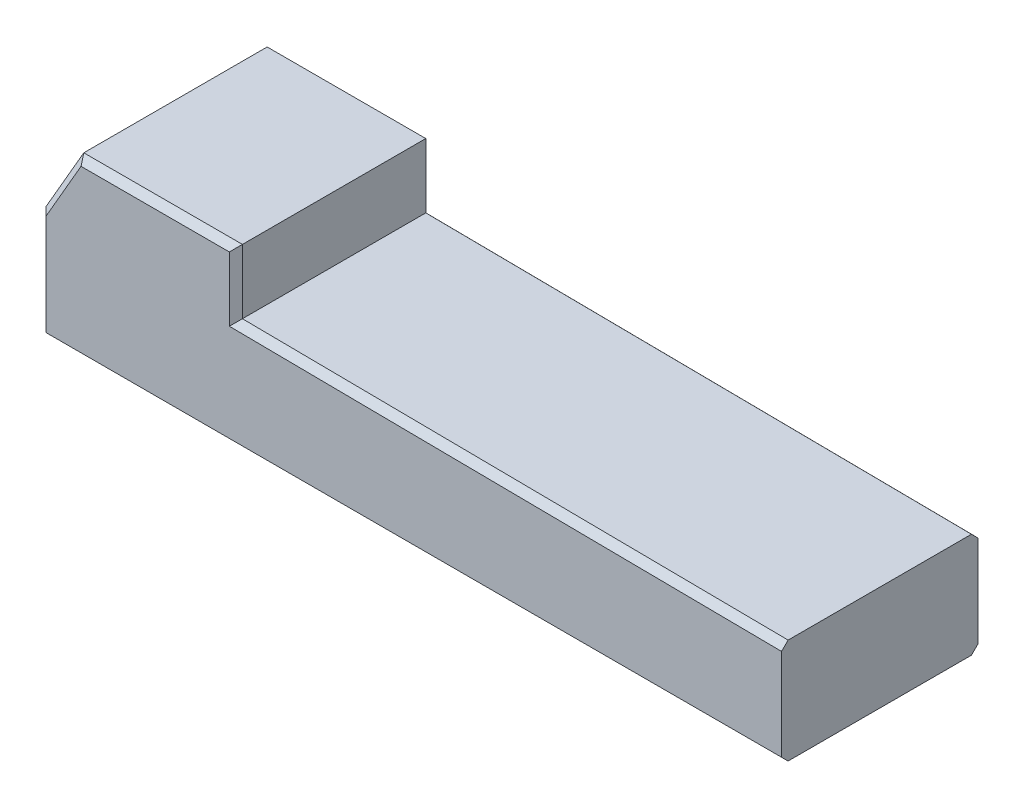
from build123d import *

# Parameters (mm, degrees)
BASEBODY_DEPTH = 36
CHAMFER1_SIZE  = 1.2


with BuildPart() as part:
    # BodySke → BaseBody (new body)
    with BuildSketch(Plane.XY):
        Polygon((80, 19.2), (80, 0), (0, 0), (-20, 0), (-56, 0), (-56, 20), (-49.07179677, 32), (-20, 32), (-20, 20.2), (0, 20), align=None)
    extrude(amount=BASEBODY_DEPTH)

    # Chamfer1
    chamfer1_edges = [part.edges().sort_by_distance(p)[0] for p in [
        (-52.535898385, 26, 0),
        (-34.535898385, 32, 0),
        (-20, 26.1, 0),
        (30, 19.7, 0),
        (30, 19.7, 36),
        (-20, 26.1, 36),
        (-34.535898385, 32, 36),
        (-52.535898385, 26, 36),
        (-56, 10, 36),
        (12, 0, 36),
        (12, 0, 0),
        (-56, 10, 0),
    ]]
    chamfer(chamfer1_edges, length=CHAMFER1_SIZE)


solid = part.part
